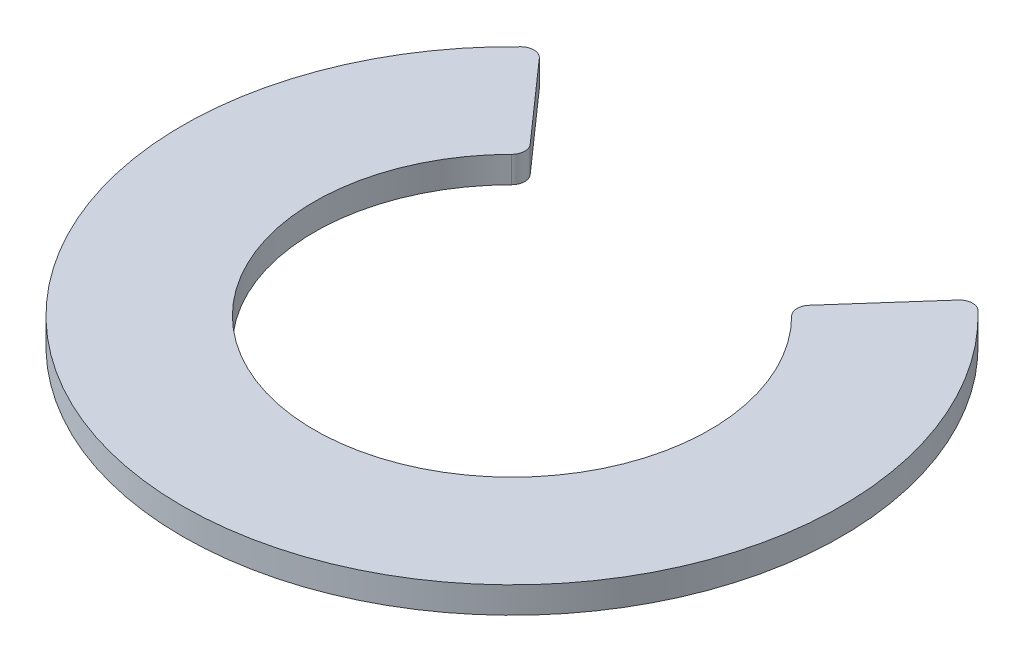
ISO-10303-21;
HEADER;
FILE_DESCRIPTION(('STEP AP214'),'2;1');
FILE_NAME('part.step','',(''),(''),'','','');
FILE_SCHEMA(('AUTOMOTIVE_DESIGN { 1 0 10303 214 1 1 1 1 }'));
ENDSEC;
DATA;
#1=APPLICATION_CONTEXT('core data for automotive mechanical design processes');
#2=APPLICATION_PROTOCOL_DEFINITION('international standard','automotive_design',2000,#1);
#3=PRODUCT_CONTEXT('',#1,'mechanical');
#4=PRODUCT('Part','Part','',(#3));
#5=PRODUCT_RELATED_PRODUCT_CATEGORY('part','',(#4));
#6=PRODUCT_DEFINITION_FORMATION('','',#4);
#7=PRODUCT_DEFINITION_CONTEXT('part definition',#1,'design');
#8=PRODUCT_DEFINITION('design','',#6,#7);
#9=PRODUCT_DEFINITION_SHAPE('','',#8);
#10=(LENGTH_UNIT() NAMED_UNIT(*) SI_UNIT(.MILLI.,.METRE.));
#11=(NAMED_UNIT(*) PLANE_ANGLE_UNIT() SI_UNIT($,.RADIAN.));
#12=(NAMED_UNIT(*) SI_UNIT($,.STERADIAN.) SOLID_ANGLE_UNIT());
#13=UNCERTAINTY_MEASURE_WITH_UNIT(LENGTH_MEASURE(1.E-05),#10,'distance_accuracy_value','');
#14=(GEOMETRIC_REPRESENTATION_CONTEXT(3) GLOBAL_UNCERTAINTY_ASSIGNED_CONTEXT((#13)) GLOBAL_UNIT_ASSIGNED_CONTEXT((#10,
#11,#12)) REPRESENTATION_CONTEXT('',''));
#15=CARTESIAN_POINT('',(0.,0.,0.));
#16=DIRECTION('',(0.,0.,1.));
#17=DIRECTION('',(1.,0.,0.));
#18=AXIS2_PLACEMENT_3D('',#15,#16,#17);
#19=CARTESIAN_POINT('',(0.,0.2,0.));
#20=DIRECTION('',(0.,-1.,0.));
#21=DIRECTION('',(0.,0.,-1.));
#22=AXIS2_PLACEMENT_3D('',#19,#20,#21);
#23=CYLINDRICAL_SURFACE('',#22,2.5);
#24=CARTESIAN_POINT('',(0.,0.,0.));
#25=DIRECTION('',(0.,1.,0.));
#26=DIRECTION('',(0.,0.,1.));
#27=AXIS2_PLACEMENT_3D('',#24,#25,#26);
#28=CIRCLE('',#27,2.5);
#29=CARTESIAN_POINT('',(-1.7330783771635,0.,-1.80178781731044));
#30=VERTEX_POINT('',#29);
#31=CARTESIAN_POINT('',(1.7330783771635,0.,-1.80178781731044));
#32=VERTEX_POINT('',#31);
#33=EDGE_CURVE('E130',#30,#32,#28,.T.);
#34=ORIENTED_EDGE('',*,*,#33,.T.);
#35=DIRECTION('',(0.,-1.,0.));
#36=VECTOR('',#35,1.);
#37=CARTESIAN_POINT('',(1.7330783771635,0.2,-1.80178781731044));
#38=LINE('',#37,#36);
#39=CARTESIAN_POINT('',(1.7330783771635,0.2,-1.80178781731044));
#40=VERTEX_POINT('',#39);
#41=EDGE_CURVE('E153',#32,#40,#38,.F.);
#42=ORIENTED_EDGE('',*,*,#41,.T.);
#43=CARTESIAN_POINT('',(0.,0.2,0.));
#44=DIRECTION('',(0.,1.,0.));
#45=DIRECTION('',(0.,0.,1.));
#46=AXIS2_PLACEMENT_3D('',#43,#44,#45);
#47=CIRCLE('',#46,2.5);
#48=CARTESIAN_POINT('',(-1.7330783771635,0.2,-1.80178781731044));
#49=VERTEX_POINT('',#48);
#50=EDGE_CURVE('E128',#49,#40,#47,.T.);
#51=ORIENTED_EDGE('',*,*,#50,.F.);
#52=DIRECTION('',(0.,-1.,0.));
#53=VECTOR('',#52,1.);
#54=CARTESIAN_POINT('',(-1.7330783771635,0.2,-1.80178781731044));
#55=LINE('',#54,#53);
#56=EDGE_CURVE('E150',#49,#30,#55,.T.);
#57=ORIENTED_EDGE('',*,*,#56,.T.);
#58=EDGE_LOOP('',(#34,#42,#51,#57));
#59=FACE_BOUND('',#58,.T.);
#60=ADVANCED_FACE('F35',(#59),#23,.T.);
#61=CARTESIAN_POINT('',(0.993899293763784,0.2,-1.12346081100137));
#62=DIRECTION('',(0.748973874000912,0.,0.662599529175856));
#63=DIRECTION('',(0.662599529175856,0.,-0.748973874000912));
#64=AXIS2_PLACEMENT_3D('',#61,#62,#63);
#65=PLANE('',#64);
#66=DIRECTION('',(-0.662599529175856,0.,0.748973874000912));
#67=VECTOR('',#66,1.);
#68=CARTESIAN_POINT('',(0.993899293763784,0.,-1.12346081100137));
#69=LINE('',#68,#67);
#70=CARTESIAN_POINT('',(1.58885785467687,0.,-1.79597625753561));
#71=VERTEX_POINT('',#70);
#72=CARTESIAN_POINT('',(1.05808659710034,0.,-1.19601536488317));
#73=VERTEX_POINT('',#72);
#74=EDGE_CURVE('E126',#71,#73,#69,.T.);
#75=ORIENTED_EDGE('',*,*,#74,.T.);
#76=DIRECTION('',(0.,-1.,0.));
#77=VECTOR('',#76,1.);
#78=CARTESIAN_POINT('',(1.05808659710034,0.2,-1.19601536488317));
#79=LINE('',#78,#77);
#80=CARTESIAN_POINT('',(1.05808659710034,0.2,-1.19601536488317));
#81=VERTEX_POINT('',#80);
#82=EDGE_CURVE('E105',#73,#81,#79,.F.);
#83=ORIENTED_EDGE('',*,*,#82,.T.);
#84=DIRECTION('',(-0.662599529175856,0.,0.748973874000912));
#85=VECTOR('',#84,1.);
#86=CARTESIAN_POINT('',(0.993899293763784,0.2,-1.12346081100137));
#87=LINE('',#86,#85);
#88=CARTESIAN_POINT('',(1.58885785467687,0.2,-1.79597625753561));
#89=VERTEX_POINT('',#88);
#90=EDGE_CURVE('E169',#89,#81,#87,.T.);
#91=ORIENTED_EDGE('',*,*,#90,.F.);
#92=DIRECTION('',(0.,-1.,0.));
#93=VECTOR('',#92,1.);
#94=CARTESIAN_POINT('',(1.58885785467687,0.2,-1.79597625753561));
#95=LINE('',#94,#93);
#96=EDGE_CURVE('E110',#89,#71,#95,.T.);
#97=ORIENTED_EDGE('',*,*,#96,.T.);
#98=EDGE_LOOP('',(#75,#83,#91,#97));
#99=FACE_BOUND('',#98,.T.);
#100=ADVANCED_FACE('F186',(#99),#65,.F.);
#101=CARTESIAN_POINT('',(0.,0.2,0.));
#102=DIRECTION('',(0.,-1.,0.));
#103=DIRECTION('',(0.,0.,-1.));
#104=AXIS2_PLACEMENT_3D('',#101,#102,#103);
#105=CYLINDRICAL_SURFACE('',#104,1.5);
#106=CARTESIAN_POINT('',(0.,0.2,0.));
#107=DIRECTION('',(0.,-1.,0.));
#108=DIRECTION('',(0.,0.,1.));
#109=AXIS2_PLACEMENT_3D('',#106,#107,#108);
#110=CIRCLE('',#109,1.5);
#111=CARTESIAN_POINT('',(1.06217248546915,0.2,-1.05914569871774));
#112=VERTEX_POINT('',#111);
#113=CARTESIAN_POINT('',(-1.06217248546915,0.2,-1.05914569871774));
#114=VERTEX_POINT('',#113);
#115=EDGE_CURVE('E119',#112,#114,#110,.T.);
#116=ORIENTED_EDGE('',*,*,#115,.F.);
#117=DIRECTION('',(0.,-1.,0.));
#118=VECTOR('',#117,1.);
#119=CARTESIAN_POINT('',(1.06217248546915,0.2,-1.05914569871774));
#120=LINE('',#119,#118);
#121=CARTESIAN_POINT('',(1.06217248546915,0.,-1.05914569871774));
#122=VERTEX_POINT('',#121);
#123=EDGE_CURVE('E104',#112,#122,#120,.T.);
#124=ORIENTED_EDGE('',*,*,#123,.T.);
#125=CARTESIAN_POINT('',(0.,0.,0.));
#126=DIRECTION('',(0.,-1.,0.));
#127=DIRECTION('',(0.,0.,1.));
#128=AXIS2_PLACEMENT_3D('',#125,#126,#127);
#129=CIRCLE('',#128,1.5);
#130=CARTESIAN_POINT('',(-1.06217248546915,0.,-1.05914569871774));
#131=VERTEX_POINT('',#130);
#132=EDGE_CURVE('E117',#122,#131,#129,.T.);
#133=ORIENTED_EDGE('',*,*,#132,.T.);
#134=DIRECTION('',(0.,-1.,0.));
#135=VECTOR('',#134,1.);
#136=CARTESIAN_POINT('',(-1.06217248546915,0.2,-1.05914569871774));
#137=LINE('',#136,#135);
#138=EDGE_CURVE('E121',#131,#114,#137,.F.);
#139=ORIENTED_EDGE('',*,*,#138,.T.);
#140=EDGE_LOOP('',(#116,#124,#133,#139));
#141=FACE_BOUND('',#140,.T.);
#142=ADVANCED_FACE('F116',(#141),#105,.F.);
#143=CARTESIAN_POINT('',(-1.65649882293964,0.2,-1.87243468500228));
#144=DIRECTION('',(-0.748973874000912,0.,0.662599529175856));
#145=DIRECTION('',(0.662599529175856,0.,0.748973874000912));
#146=AXIS2_PLACEMENT_3D('',#143,#144,#145);
#147=PLANE('',#146);
#148=DIRECTION('',(-0.662599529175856,0.,-0.748973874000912));
#149=VECTOR('',#148,1.);
#150=CARTESIAN_POINT('',(-1.65649882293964,0.,-1.87243468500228));
#151=LINE('',#150,#149);
#152=CARTESIAN_POINT('',(-1.05808659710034,0.,-1.19601536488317));
#153=VERTEX_POINT('',#152);
#154=CARTESIAN_POINT('',(-1.58885785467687,0.,-1.79597625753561));
#155=VERTEX_POINT('',#154);
#156=EDGE_CURVE('E125',#153,#155,#151,.T.);
#157=ORIENTED_EDGE('',*,*,#156,.T.);
#158=DIRECTION('',(0.,-1.,0.));
#159=VECTOR('',#158,1.);
#160=CARTESIAN_POINT('',(-1.58885785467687,0.2,-1.79597625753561));
#161=LINE('',#160,#159);
#162=CARTESIAN_POINT('',(-1.58885785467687,0.2,-1.79597625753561));
#163=VERTEX_POINT('',#162);
#164=EDGE_CURVE('E11',#155,#163,#161,.F.);
#165=ORIENTED_EDGE('',*,*,#164,.T.);
#166=DIRECTION('',(-0.662599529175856,0.,-0.748973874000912));
#167=VECTOR('',#166,1.);
#168=CARTESIAN_POINT('',(-1.65649882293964,0.2,-1.87243468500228));
#169=LINE('',#168,#167);
#170=CARTESIAN_POINT('',(-1.05808659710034,0.2,-1.19601536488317));
#171=VERTEX_POINT('',#170);
#172=EDGE_CURVE('E134',#171,#163,#169,.T.);
#173=ORIENTED_EDGE('',*,*,#172,.F.);
#174=DIRECTION('',(0.,-1.,0.));
#175=VECTOR('',#174,1.);
#176=CARTESIAN_POINT('',(-1.05808659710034,0.2,-1.19601536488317));
#177=LINE('',#176,#175);
#178=EDGE_CURVE('E43',#171,#153,#177,.T.);
#179=ORIENTED_EDGE('',*,*,#178,.T.);
#180=EDGE_LOOP('',(#157,#165,#173,#179));
#181=FACE_BOUND('',#180,.T.);
#182=ADVANCED_FACE('F156',(#181),#147,.F.);
#183=CARTESIAN_POINT('',(0.,0.2,0.));
#184=DIRECTION('',(0.,1.,0.));
#185=DIRECTION('',(0.,0.,1.));
#186=AXIS2_PLACEMENT_3D('',#183,#184,#185);
#187=PLANE('',#186);
#188=ORIENTED_EDGE('',*,*,#90,.T.);
#189=CARTESIAN_POINT('',(1.13298398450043,0.2,-1.12975541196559));
#190=DIRECTION('',(0.,1.,0.));
#191=DIRECTION('',(0.,0.,1.));
#192=AXIS2_PLACEMENT_3D('',#189,#190,#191);
#193=CIRCLE('',#192,0.1);
#194=EDGE_CURVE('E148',#81,#112,#193,.T.);
#195=ORIENTED_EDGE('',*,*,#194,.T.);
#196=ORIENTED_EDGE('',*,*,#115,.T.);
#197=CARTESIAN_POINT('',(-1.13298398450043,0.2,-1.12975541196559));
#198=DIRECTION('',(0.,1.,0.));
#199=DIRECTION('',(0.,0.,1.));
#200=AXIS2_PLACEMENT_3D('',#197,#198,#199);
#201=CIRCLE('',#200,0.1);
#202=EDGE_CURVE('E55',#114,#171,#201,.T.);
#203=ORIENTED_EDGE('',*,*,#202,.T.);
#204=ORIENTED_EDGE('',*,*,#172,.T.);
#205=CARTESIAN_POINT('',(-1.66375524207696,0.2,-1.72971630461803));
#206=DIRECTION('',(0.,1.,0.));
#207=DIRECTION('',(0.,0.,1.));
#208=AXIS2_PLACEMENT_3D('',#205,#206,#207);
#209=CIRCLE('',#208,0.1);
#210=EDGE_CURVE('E144',#163,#49,#209,.T.);
#211=ORIENTED_EDGE('',*,*,#210,.T.);
#212=ORIENTED_EDGE('',*,*,#50,.T.);
#213=CARTESIAN_POINT('',(1.66375524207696,0.2,-1.72971630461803));
#214=DIRECTION('',(0.,1.,0.));
#215=DIRECTION('',(0.,0.,1.));
#216=AXIS2_PLACEMENT_3D('',#213,#214,#215);
#217=CIRCLE('',#216,0.1);
#218=EDGE_CURVE('E146',#40,#89,#217,.T.);
#219=ORIENTED_EDGE('',*,*,#218,.T.);
#220=EDGE_LOOP('',(#188,#195,#196,#203,#204,#211,#212,#219));
#221=FACE_BOUND('',#220,.T.);
#222=ADVANCED_FACE('F175',(#221),#187,.T.);
#223=CARTESIAN_POINT('',(0.,0.,0.));
#224=DIRECTION('',(0.,1.,0.));
#225=DIRECTION('',(0.,0.,1.));
#226=AXIS2_PLACEMENT_3D('',#223,#224,#225);
#227=PLANE('',#226);
#228=ORIENTED_EDGE('',*,*,#132,.F.);
#229=CARTESIAN_POINT('',(1.13298398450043,0.,-1.12975541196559));
#230=DIRECTION('',(0.,1.,0.));
#231=DIRECTION('',(0.,0.,1.));
#232=AXIS2_PLACEMENT_3D('',#229,#230,#231);
#233=CIRCLE('',#232,0.1);
#234=EDGE_CURVE('E100',#122,#73,#233,.F.);
#235=ORIENTED_EDGE('',*,*,#234,.T.);
#236=ORIENTED_EDGE('',*,*,#74,.F.);
#237=CARTESIAN_POINT('',(1.66375524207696,0.,-1.72971630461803));
#238=DIRECTION('',(0.,1.,0.));
#239=DIRECTION('',(0.,0.,1.));
#240=AXIS2_PLACEMENT_3D('',#237,#238,#239);
#241=CIRCLE('',#240,0.1);
#242=EDGE_CURVE('E111',#71,#32,#241,.F.);
#243=ORIENTED_EDGE('',*,*,#242,.T.);
#244=ORIENTED_EDGE('',*,*,#33,.F.);
#245=CARTESIAN_POINT('',(-1.66375524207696,0.,-1.72971630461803));
#246=DIRECTION('',(0.,1.,0.));
#247=DIRECTION('',(0.,0.,1.));
#248=AXIS2_PLACEMENT_3D('',#245,#246,#247);
#249=CIRCLE('',#248,0.1);
#250=EDGE_CURVE('E137',#30,#155,#249,.F.);
#251=ORIENTED_EDGE('',*,*,#250,.T.);
#252=ORIENTED_EDGE('',*,*,#156,.F.);
#253=CARTESIAN_POINT('',(-1.13298398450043,0.,-1.12975541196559));
#254=DIRECTION('',(0.,1.,0.));
#255=DIRECTION('',(0.,0.,1.));
#256=AXIS2_PLACEMENT_3D('',#253,#254,#255);
#257=CIRCLE('',#256,0.1);
#258=EDGE_CURVE('E120',#153,#131,#257,.F.);
#259=ORIENTED_EDGE('',*,*,#258,.T.);
#260=EDGE_LOOP('',(#228,#235,#236,#243,#244,#251,#252,#259));
#261=FACE_BOUND('',#260,.T.);
#262=ADVANCED_FACE('F123',(#261),#227,.F.);
#263=CARTESIAN_POINT('',(1.13298398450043,0.2,-1.12975541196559));
#264=DIRECTION('',(0.,-1.,0.));
#265=DIRECTION('',(0.,0.,-1.));
#266=AXIS2_PLACEMENT_3D('',#263,#264,#265);
#267=CYLINDRICAL_SURFACE('',#266,0.1);
#268=ORIENTED_EDGE('',*,*,#194,.F.);
#269=ORIENTED_EDGE('',*,*,#82,.F.);
#270=ORIENTED_EDGE('',*,*,#234,.F.);
#271=ORIENTED_EDGE('',*,*,#123,.F.);
#272=EDGE_LOOP('',(#268,#269,#270,#271));
#273=FACE_BOUND('',#272,.T.);
#274=ADVANCED_FACE('F103',(#273),#267,.T.);
#275=CARTESIAN_POINT('',(1.66375524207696,0.2,-1.72971630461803));
#276=DIRECTION('',(0.,-1.,0.));
#277=DIRECTION('',(0.,0.,-1.));
#278=AXIS2_PLACEMENT_3D('',#275,#276,#277);
#279=CYLINDRICAL_SURFACE('',#278,0.1);
#280=ORIENTED_EDGE('',*,*,#218,.F.);
#281=ORIENTED_EDGE('',*,*,#41,.F.);
#282=ORIENTED_EDGE('',*,*,#242,.F.);
#283=ORIENTED_EDGE('',*,*,#96,.F.);
#284=EDGE_LOOP('',(#280,#281,#282,#283));
#285=FACE_BOUND('',#284,.T.);
#286=ADVANCED_FACE('F197',(#285),#279,.T.);
#287=CARTESIAN_POINT('',(-1.66375524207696,0.2,-1.72971630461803));
#288=DIRECTION('',(0.,-1.,0.));
#289=DIRECTION('',(0.,0.,-1.));
#290=AXIS2_PLACEMENT_3D('',#287,#288,#289);
#291=CYLINDRICAL_SURFACE('',#290,0.1);
#292=ORIENTED_EDGE('',*,*,#210,.F.);
#293=ORIENTED_EDGE('',*,*,#164,.F.);
#294=ORIENTED_EDGE('',*,*,#250,.F.);
#295=ORIENTED_EDGE('',*,*,#56,.F.);
#296=EDGE_LOOP('',(#292,#293,#294,#295));
#297=FACE_BOUND('',#296,.T.);
#298=ADVANCED_FACE('F163',(#297),#291,.T.);
#299=CARTESIAN_POINT('',(-1.13298398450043,0.2,-1.12975541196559));
#300=DIRECTION('',(0.,-1.,0.));
#301=DIRECTION('',(0.,0.,-1.));
#302=AXIS2_PLACEMENT_3D('',#299,#300,#301);
#303=CYLINDRICAL_SURFACE('',#302,0.1);
#304=ORIENTED_EDGE('',*,*,#202,.F.);
#305=ORIENTED_EDGE('',*,*,#138,.F.);
#306=ORIENTED_EDGE('',*,*,#258,.F.);
#307=ORIENTED_EDGE('',*,*,#178,.F.);
#308=EDGE_LOOP('',(#304,#305,#306,#307));
#309=FACE_BOUND('',#308,.T.);
#310=ADVANCED_FACE('F37',(#309),#303,.T.);
#311=CLOSED_SHELL('',(#60,#100,#142,#182,#222,#262,#274,#286,#298,#310));
#312=MANIFOLD_SOLID_BREP('B2',#311);
#313=ADVANCED_BREP_SHAPE_REPRESENTATION('',(#18,#312),#14);
#314=SHAPE_DEFINITION_REPRESENTATION(#9,#313);
ENDSEC;
END-ISO-10303-21;
